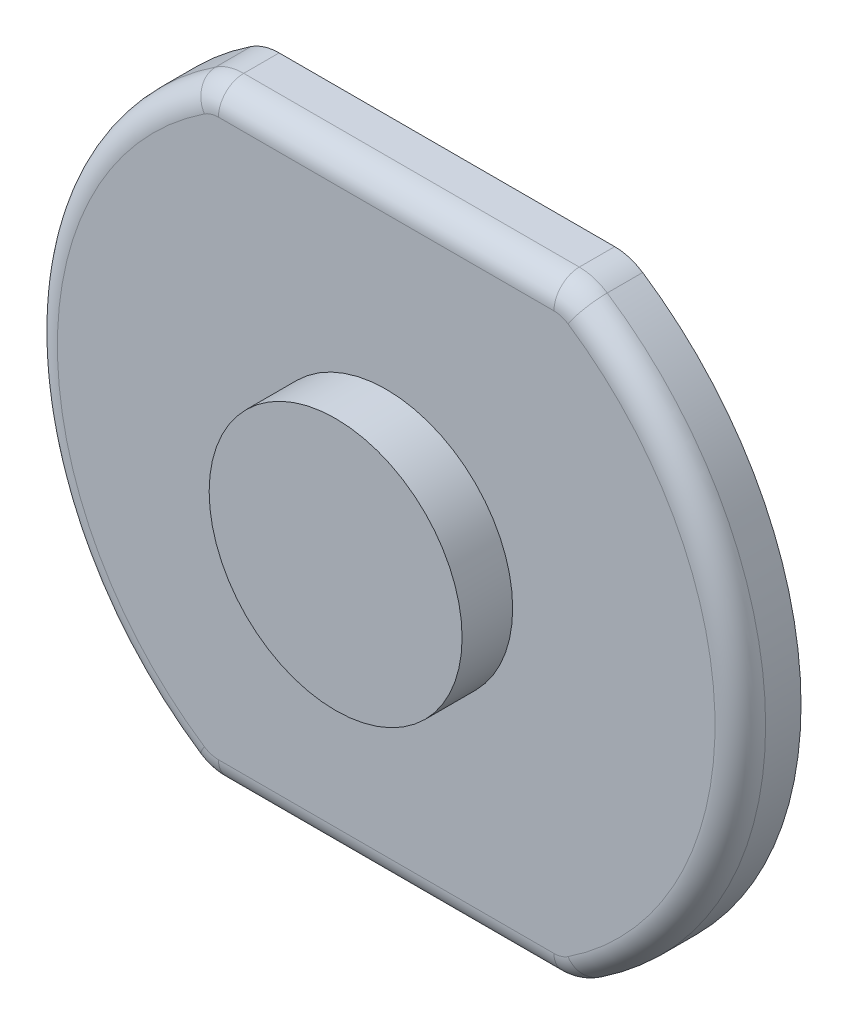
from build123d import *

# Parameters (mm, degrees)
EXTRUSION1_DEPTH = 1.2
CONG_1_R         = 0.5
ESQUISSE2_R      = 2.5
EXTRUSION2_DEPTH = 1


with BuildPart() as part:
    # Esquisse1 → Extrusion1 (new body)
    with BuildSketch(Plane.XY):
        with BuildLine():
            Line((-3.31662479, -6), (3.31662479, -6))
            ThreePointArc((3.31662479, -6), (3.605299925, -5.957427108), (3.869395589, -5.833333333))
            ThreePointArc((3.869395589, -5.833333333), (7, 0), (3.869395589, 5.833333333))
            ThreePointArc((3.869395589, 5.833333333), (3.605299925, 5.957427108), (3.31662479, 6))
            Line((3.31662479, 6), (-3.31662479, 6))
            ThreePointArc((-3.31662479, 6), (-3.605299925, 5.957427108), (-3.869395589, 5.833333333))
            ThreePointArc((-3.869395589, 5.833333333), (-7, 0), (-3.869395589, -5.833333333))
            ThreePointArc((-3.869395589, -5.833333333), (-3.605299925, -5.957427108), (-3.31662479, -6))
        make_face()
    extrude(amount=EXTRUSION1_DEPTH)

    # Cong_1
    cong_1_edges = [part.edges().sort_by_distance(p)[0] for p in [
        (0, -6, 1.2),
        (3.605299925, -5.957427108, 1.2),
        (7, 0, 1.2),
        (3.605299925, 5.957427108, 1.2),
        (0, 6, 1.2),
        (-3.605299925, 5.957427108, 1.2),
        (-7, 0, 1.2),
        (-3.605299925, -5.957427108, 1.2),
    ]]
    fillet(cong_1_edges, radius=CONG_1_R)

    # Esquisse2 → Extrusion2 (add)
    with BuildSketch(Plane.XY.offset(1.2)):
        Circle(ESQUISSE2_R)
    extrude(amount=EXTRUSION2_DEPTH)


solid = part.part
